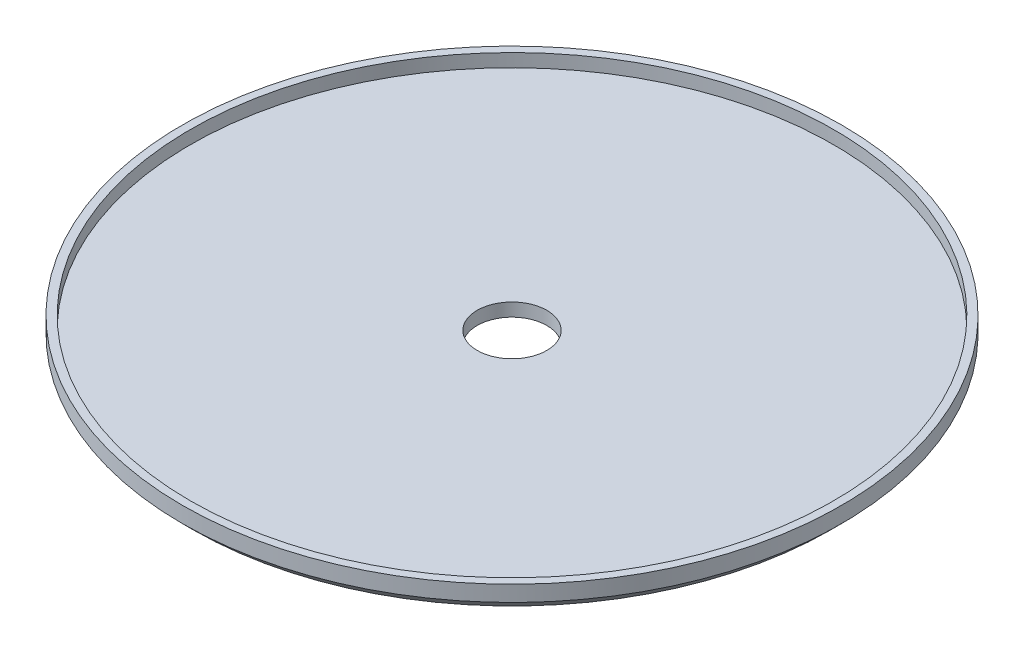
from build123d import *

# Parameters (mm, degrees)
SKETCH1_R          = 158.75
EXTRUDE1_DEPTH     = 12.7
SKETCH2_R          = 154.94
CUT_EXTRUDE1_DEPTH = 6.35
SKETCH3_R          = 16.764
CUT_EXTRUDE2_DEPTH = 225.865326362
CHAMFER1_SIZE      = 5.08


with BuildPart() as part:
    # Sketch1 → Extrude1 (new body)
    with BuildSketch(Plane(origin=(0, 0, 0), x_dir=(1, 0, 0), z_dir=(0, 1, 0))):
        with Locations(Location((0, 0, 0), (0, 0, 270))):
            Circle(SKETCH1_R)
    extrude(amount=EXTRUDE1_DEPTH)

    # Sketch2 → Cut-Extrude1 (cut)
    with BuildSketch(Plane(origin=(0, 12.7, 0), x_dir=(-1, 0, 0), z_dir=(0, 1, 0))):
        with Locations(Location((0, 0, 0), (0, 0, 90))):
            Circle(SKETCH2_R)
    extrude(amount=-CUT_EXTRUDE1_DEPTH, mode=Mode.SUBTRACT)

    # Sketch3 → Cut-Extrude2 (cut, through all)
    with BuildSketch(Plane.XZ):
        with Locations(Location((0, 0, 0), (0, 0, 270))):
            Circle(SKETCH3_R)
    extrude(amount=-CUT_EXTRUDE2_DEPTH, mode=Mode.SUBTRACT)

    # Chamfer1
    chamfer1_edges = [part.edges().sort_by_distance(p)[0] for p in [
        (0, 0, -158.75),
    ]]
    chamfer(chamfer1_edges, length=CHAMFER1_SIZE)


solid = part.part
